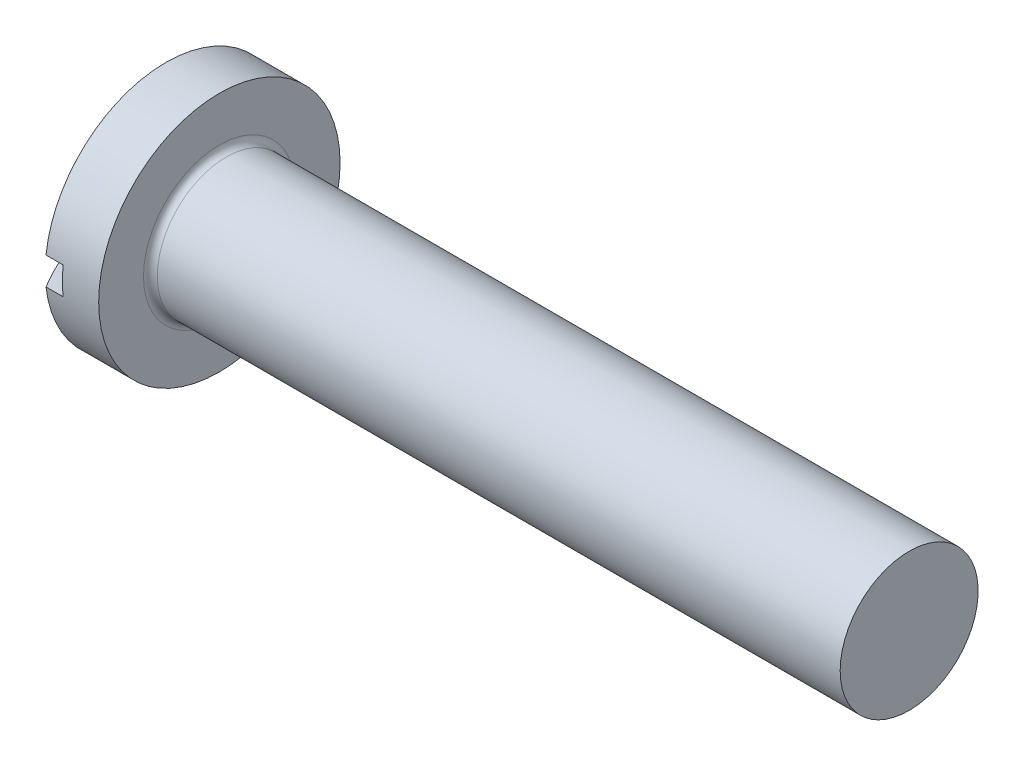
ISO-10303-21;
HEADER;
FILE_DESCRIPTION(('STEP AP214'),'2;1');
FILE_NAME('part.step','',(''),(''),'','','');
FILE_SCHEMA(('AUTOMOTIVE_DESIGN { 1 0 10303 214 1 1 1 1 }'));
ENDSEC;
DATA;
#1=APPLICATION_CONTEXT('core data for automotive mechanical design processes');
#2=APPLICATION_PROTOCOL_DEFINITION('international standard','automotive_design',2000,#1);
#3=PRODUCT_CONTEXT('',#1,'mechanical');
#4=PRODUCT('Part','Part','',(#3));
#5=PRODUCT_RELATED_PRODUCT_CATEGORY('part','',(#4));
#6=PRODUCT_DEFINITION_FORMATION('','',#4);
#7=PRODUCT_DEFINITION_CONTEXT('part definition',#1,'design');
#8=PRODUCT_DEFINITION('design','',#6,#7);
#9=PRODUCT_DEFINITION_SHAPE('','',#8);
#10=(LENGTH_UNIT() NAMED_UNIT(*) SI_UNIT(.MILLI.,.METRE.));
#11=(NAMED_UNIT(*) PLANE_ANGLE_UNIT() SI_UNIT($,.RADIAN.));
#12=(NAMED_UNIT(*) SI_UNIT($,.STERADIAN.) SOLID_ANGLE_UNIT());
#13=UNCERTAINTY_MEASURE_WITH_UNIT(LENGTH_MEASURE(1.E-05),#10,'distance_accuracy_value','');
#14=(GEOMETRIC_REPRESENTATION_CONTEXT(3) GLOBAL_UNCERTAINTY_ASSIGNED_CONTEXT((#13)) GLOBAL_UNIT_ASSIGNED_CONTEXT((#10,
#11,#12)) REPRESENTATION_CONTEXT('',''));
#15=CARTESIAN_POINT('',(0.,0.,0.));
#16=DIRECTION('',(0.,0.,1.));
#17=DIRECTION('',(1.,0.,0.));
#18=AXIS2_PLACEMENT_3D('',#15,#16,#17);
#19=CARTESIAN_POINT('',(13.25,0.,0.));
#20=DIRECTION('',(-1.,0.,0.));
#21=DIRECTION('',(0.,1.,0.));
#22=AXIS2_PLACEMENT_3D('',#19,#20,#21);
#23=SPHERICAL_SURFACE('',#22,13.25);
#24=CARTESIAN_POINT('',(13.25,0.8,0.));
#25=DIRECTION('',(0.,-1.,0.));
#26=DIRECTION('',(0.,0.,-1.));
#27=AXIS2_PLACEMENT_3D('',#24,#25,#26);
#28=CIRCLE('',#27,13.2258270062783);
#29=CARTESIAN_POINT('',(2.,0.799999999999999,6.95413546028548));
#30=VERTEX_POINT('',#29);
#31=CARTESIAN_POINT('',(2.,0.800000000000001,-6.95413546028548));
#32=VERTEX_POINT('',#31);
#33=EDGE_CURVE('E85',#30,#32,#28,.T.);
#34=ORIENTED_EDGE('',*,*,#33,.F.);
#35=CARTESIAN_POINT('',(2.,0.,0.));
#36=DIRECTION('',(-1.,0.,0.));
#37=DIRECTION('',(0.,0.,1.));
#38=AXIS2_PLACEMENT_3D('',#35,#36,#37);
#39=CIRCLE('',#38,7.);
#40=EDGE_CURVE('E103',#30,#32,#39,.T.);
#41=ORIENTED_EDGE('',*,*,#40,.T.);
#42=EDGE_LOOP('',(#34,#41));
#43=FACE_BOUND('',#42,.T.);
#44=ADVANCED_FACE('F33',(#43),#23,.T.);
#45=CARTESIAN_POINT('',(13.25,-0.8,0.));
#46=DIRECTION('',(0.,1.,0.));
#47=DIRECTION('',(0.,0.,1.));
#48=AXIS2_PLACEMENT_3D('',#45,#46,#47);
#49=CIRCLE('',#48,13.2258270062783);
#50=CARTESIAN_POINT('',(2.,-0.799999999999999,-6.95413546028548));
#51=VERTEX_POINT('',#50);
#52=CARTESIAN_POINT('',(2.,-0.800000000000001,6.95413546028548));
#53=VERTEX_POINT('',#52);
#54=EDGE_CURVE('E89',#51,#53,#49,.T.);
#55=ORIENTED_EDGE('',*,*,#54,.F.);
#56=EDGE_CURVE('E100',#51,#53,#39,.T.);
#57=ORIENTED_EDGE('',*,*,#56,.T.);
#58=EDGE_LOOP('',(#55,#57));
#59=FACE_BOUND('',#58,.T.);
#60=ADVANCED_FACE('F117',(#59),#23,.T.);
#61=CARTESIAN_POINT('',(0.,0.,0.));
#62=DIRECTION('',(-1.,0.,0.));
#63=DIRECTION('',(0.,0.,1.));
#64=AXIS2_PLACEMENT_3D('',#61,#62,#63);
#65=CYLINDRICAL_SURFACE('',#64,7.);
#66=CARTESIAN_POINT('',(5.1,0.,0.));
#67=DIRECTION('',(-1.,0.,0.));
#68=DIRECTION('',(0.,0.,1.));
#69=AXIS2_PLACEMENT_3D('',#66,#67,#68);
#70=CIRCLE('',#69,7.);
#71=CARTESIAN_POINT('',(5.1,0.,7.));
#72=VERTEX_POINT('',#71);
#73=EDGE_CURVE('E97',#72,#72,#70,.T.);
#74=ORIENTED_EDGE('',*,*,#73,.T.);
#75=EDGE_LOOP('',(#74));
#76=FACE_BOUND('',#75,.T.);
#77=DIRECTION('',(-1.,0.,0.));
#78=VECTOR('',#77,1.);
#79=CARTESIAN_POINT('',(0.,0.800000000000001,-6.95413546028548));
#80=LINE('',#79,#78);
#81=CARTESIAN_POINT('',(3.,0.800000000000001,-6.95413546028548));
#82=VERTEX_POINT('',#81);
#83=EDGE_CURVE('E11',#32,#82,#80,.F.);
#84=ORIENTED_EDGE('',*,*,#83,.F.);
#85=ORIENTED_EDGE('',*,*,#40,.F.);
#86=DIRECTION('',(-1.,0.,0.));
#87=VECTOR('',#86,1.);
#88=CARTESIAN_POINT('',(0.,0.799999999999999,6.95413546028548));
#89=LINE('',#88,#87);
#90=CARTESIAN_POINT('',(3.,0.799999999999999,6.95413546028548));
#91=VERTEX_POINT('',#90);
#92=EDGE_CURVE('E56',#91,#30,#89,.T.);
#93=ORIENTED_EDGE('',*,*,#92,.F.);
#94=CARTESIAN_POINT('',(3.,0.,0.));
#95=DIRECTION('',(-1.,0.,0.));
#96=DIRECTION('',(0.,0.,1.));
#97=AXIS2_PLACEMENT_3D('',#94,#95,#96);
#98=CIRCLE('',#97,7.);
#99=CARTESIAN_POINT('',(3.,-0.800000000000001,6.95413546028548));
#100=VERTEX_POINT('',#99);
#101=EDGE_CURVE('E82',#100,#91,#98,.T.);
#102=ORIENTED_EDGE('',*,*,#101,.F.);
#103=DIRECTION('',(-1.,0.,0.));
#104=VECTOR('',#103,1.);
#105=CARTESIAN_POINT('',(0.,-0.800000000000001,6.95413546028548));
#106=LINE('',#105,#104);
#107=EDGE_CURVE('E110',#53,#100,#106,.F.);
#108=ORIENTED_EDGE('',*,*,#107,.F.);
#109=ORIENTED_EDGE('',*,*,#56,.F.);
#110=DIRECTION('',(-1.,0.,0.));
#111=VECTOR('',#110,1.);
#112=CARTESIAN_POINT('',(0.,-0.799999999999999,-6.95413546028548));
#113=LINE('',#112,#111);
#114=CARTESIAN_POINT('',(3.,-0.799999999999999,-6.95413546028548));
#115=VERTEX_POINT('',#114);
#116=EDGE_CURVE('E41',#115,#51,#113,.T.);
#117=ORIENTED_EDGE('',*,*,#116,.F.);
#118=EDGE_CURVE('E75',#82,#115,#98,.T.);
#119=ORIENTED_EDGE('',*,*,#118,.F.);
#120=EDGE_LOOP('',(#84,#85,#93,#102,#108,#109,#117,#119));
#121=FACE_BOUND('',#120,.T.);
#122=ADVANCED_FACE('F76',(#76,#121),#65,.T.);
#123=CARTESIAN_POINT('',(5.1,7.,0.));
#124=DIRECTION('',(-1.,0.,0.));
#125=DIRECTION('',(0.,0.,1.));
#126=AXIS2_PLACEMENT_3D('',#123,#124,#125);
#127=PLANE('',#126);
#128=CARTESIAN_POINT('',(5.1,0.,0.));
#129=DIRECTION('',(-1.,0.,0.));
#130=DIRECTION('',(0.,0.,1.));
#131=AXIS2_PLACEMENT_3D('',#128,#129,#130);
#132=CIRCLE('',#131,4.4);
#133=CARTESIAN_POINT('',(5.1,0.,4.4));
#134=VERTEX_POINT('',#133);
#135=EDGE_CURVE('E104',#134,#134,#132,.T.);
#136=ORIENTED_EDGE('',*,*,#135,.T.);
#137=EDGE_LOOP('',(#136));
#138=FACE_BOUND('',#137,.T.);
#139=ORIENTED_EDGE('',*,*,#73,.F.);
#140=EDGE_LOOP('',(#139));
#141=FACE_BOUND('',#140,.T.);
#142=ADVANCED_FACE('F126',(#138,#141),#127,.F.);
#143=CARTESIAN_POINT('',(0.,0.,0.));
#144=DIRECTION('',(-1.,0.,0.));
#145=DIRECTION('',(0.,0.,1.));
#146=AXIS2_PLACEMENT_3D('',#143,#144,#145);
#147=CYLINDRICAL_SURFACE('',#146,4.);
#148=CARTESIAN_POINT('',(5.5,0.,0.));
#149=DIRECTION('',(-1.,0.,0.));
#150=DIRECTION('',(0.,0.,1.));
#151=AXIS2_PLACEMENT_3D('',#148,#149,#150);
#152=CIRCLE('',#151,4.);
#153=CARTESIAN_POINT('',(5.5,0.,4.));
#154=VERTEX_POINT('',#153);
#155=EDGE_CURVE('E107',#154,#154,#152,.F.);
#156=ORIENTED_EDGE('',*,*,#155,.T.);
#157=EDGE_LOOP('',(#156));
#158=FACE_BOUND('',#157,.T.);
#159=CARTESIAN_POINT('',(45.1,0.,0.));
#160=DIRECTION('',(-1.,0.,0.));
#161=DIRECTION('',(0.,0.,1.));
#162=AXIS2_PLACEMENT_3D('',#159,#160,#161);
#163=CIRCLE('',#162,4.);
#164=CARTESIAN_POINT('',(45.1,0.,4.));
#165=VERTEX_POINT('',#164);
#166=EDGE_CURVE('E94',#165,#165,#163,.T.);
#167=ORIENTED_EDGE('',*,*,#166,.T.);
#168=EDGE_LOOP('',(#167));
#169=FACE_BOUND('',#168,.T.);
#170=ADVANCED_FACE('F130',(#158,#169),#147,.T.);
#171=CARTESIAN_POINT('',(45.1,4.,0.));
#172=DIRECTION('',(-1.,0.,0.));
#173=DIRECTION('',(0.,0.,1.));
#174=AXIS2_PLACEMENT_3D('',#171,#172,#173);
#175=PLANE('',#174);
#176=ORIENTED_EDGE('',*,*,#166,.F.);
#177=EDGE_LOOP('',(#176));
#178=FACE_BOUND('',#177,.T.);
#179=ADVANCED_FACE('F134',(#178),#175,.F.);
#180=CARTESIAN_POINT('',(5.5,0.,0.));
#181=DIRECTION('',(-1.,0.,0.));
#182=DIRECTION('',(0.,0.,1.));
#183=AXIS2_PLACEMENT_3D('',#180,#181,#182);
#184=TOROIDAL_SURFACE('',#183,4.4,0.4);
#185=ORIENTED_EDGE('',*,*,#155,.F.);
#186=EDGE_LOOP('',(#185));
#187=FACE_BOUND('',#186,.T.);
#188=ORIENTED_EDGE('',*,*,#135,.F.);
#189=EDGE_LOOP('',(#188));
#190=FACE_BOUND('',#189,.T.);
#191=ADVANCED_FACE('F35',(#187,#190),#184,.F.);
#192=CARTESIAN_POINT('',(3.,0.800000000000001,-7.));
#193=DIRECTION('',(0.,-1.,0.));
#194=DIRECTION('',(0.,0.,-1.));
#195=AXIS2_PLACEMENT_3D('',#192,#193,#194);
#196=PLANE('',#195);
#197=ORIENTED_EDGE('',*,*,#92,.T.);
#198=ORIENTED_EDGE('',*,*,#33,.T.);
#199=ORIENTED_EDGE('',*,*,#83,.T.);
#200=DIRECTION('',(0.,0.,1.));
#201=VECTOR('',#200,1.);
#202=CARTESIAN_POINT('',(3.,0.800000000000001,-7.));
#203=LINE('',#202,#201);
#204=EDGE_CURVE('E84',#82,#91,#203,.T.);
#205=ORIENTED_EDGE('',*,*,#204,.T.);
#206=EDGE_LOOP('',(#197,#198,#199,#205));
#207=FACE_BOUND('',#206,.T.);
#208=ADVANCED_FACE('F83',(#207),#196,.T.);
#209=CARTESIAN_POINT('',(3.,-0.799999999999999,-7.));
#210=DIRECTION('',(0.,1.,0.));
#211=DIRECTION('',(0.,0.,1.));
#212=AXIS2_PLACEMENT_3D('',#209,#210,#211);
#213=PLANE('',#212);
#214=ORIENTED_EDGE('',*,*,#116,.T.);
#215=ORIENTED_EDGE('',*,*,#54,.T.);
#216=ORIENTED_EDGE('',*,*,#107,.T.);
#217=DIRECTION('',(0.,0.,-1.));
#218=VECTOR('',#217,1.);
#219=CARTESIAN_POINT('',(3.,-0.799999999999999,-7.));
#220=LINE('',#219,#218);
#221=EDGE_CURVE('E48',#100,#115,#220,.T.);
#222=ORIENTED_EDGE('',*,*,#221,.T.);
#223=EDGE_LOOP('',(#214,#215,#216,#222));
#224=FACE_BOUND('',#223,.T.);
#225=ADVANCED_FACE('F114',(#224),#213,.T.);
#226=CARTESIAN_POINT('',(3.,0.800000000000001,-7.));
#227=DIRECTION('',(-1.,0.,0.));
#228=DIRECTION('',(0.,0.,1.));
#229=AXIS2_PLACEMENT_3D('',#226,#227,#228);
#230=PLANE('',#229);
#231=ORIENTED_EDGE('',*,*,#204,.F.);
#232=ORIENTED_EDGE('',*,*,#118,.T.);
#233=ORIENTED_EDGE('',*,*,#221,.F.);
#234=ORIENTED_EDGE('',*,*,#101,.T.);
#235=EDGE_LOOP('',(#231,#232,#233,#234));
#236=FACE_BOUND('',#235,.T.);
#237=ADVANCED_FACE('F86',(#236),#230,.T.);
#238=CLOSED_SHELL('',(#44,#60,#122,#142,#170,#179,#191,#208,#225,#237));
#239=MANIFOLD_SOLID_BREP('B2',#238);
#240=ADVANCED_BREP_SHAPE_REPRESENTATION('',(#18,#239),#14);
#241=SHAPE_DEFINITION_REPRESENTATION(#9,#240);
ENDSEC;
END-ISO-10303-21;
